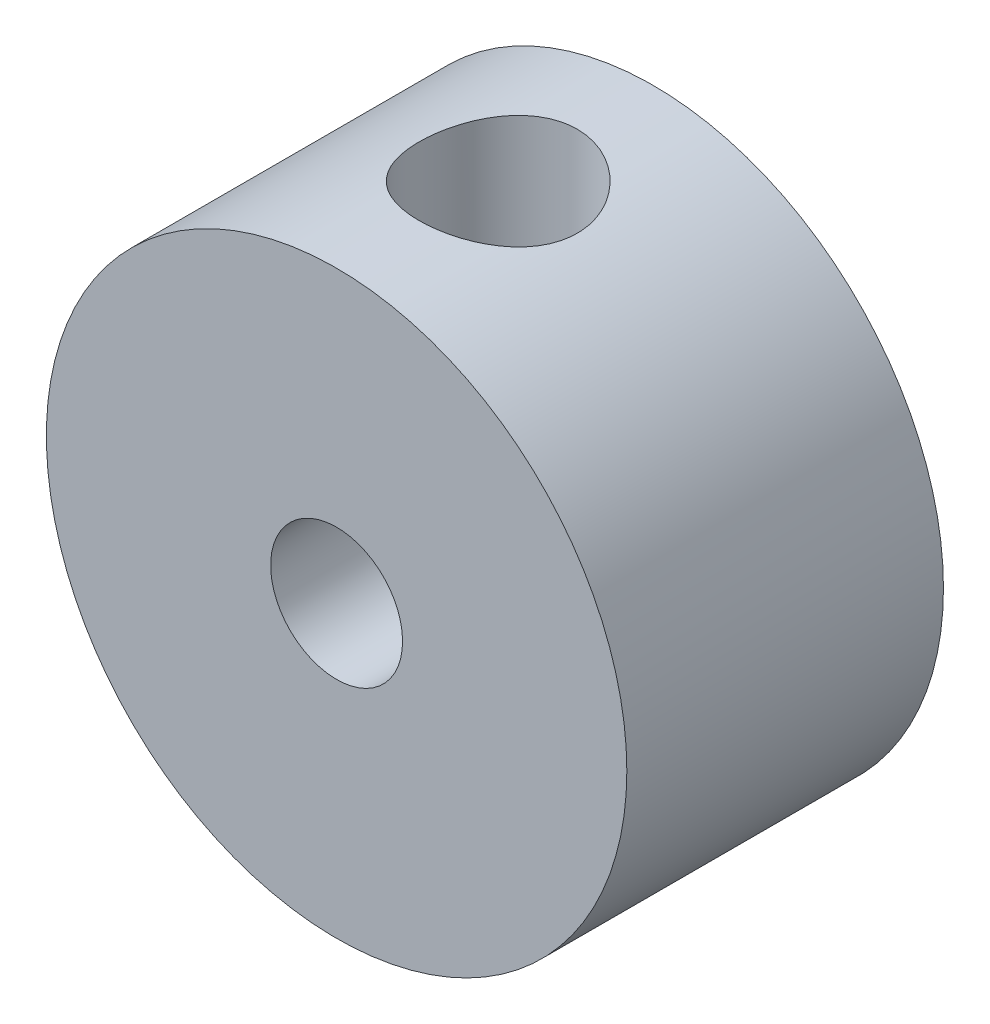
ISO-10303-21;
HEADER;
FILE_DESCRIPTION(('STEP AP214'),'2;1');
FILE_NAME('part.step','',(''),(''),'','','');
FILE_SCHEMA(('AUTOMOTIVE_DESIGN { 1 0 10303 214 1 1 1 1 }'));
ENDSEC;
DATA;
#1=APPLICATION_CONTEXT('core data for automotive mechanical design processes');
#2=APPLICATION_PROTOCOL_DEFINITION('international standard','automotive_design',2000,#1);
#3=PRODUCT_CONTEXT('',#1,'mechanical');
#4=PRODUCT('Part','Part','',(#3));
#5=PRODUCT_RELATED_PRODUCT_CATEGORY('part','',(#4));
#6=PRODUCT_DEFINITION_FORMATION('','',#4);
#7=PRODUCT_DEFINITION_CONTEXT('part definition',#1,'design');
#8=PRODUCT_DEFINITION('design','',#6,#7);
#9=PRODUCT_DEFINITION_SHAPE('','',#8);
#10=(LENGTH_UNIT() NAMED_UNIT(*) SI_UNIT(.MILLI.,.METRE.));
#11=(NAMED_UNIT(*) PLANE_ANGLE_UNIT() SI_UNIT($,.RADIAN.));
#12=(NAMED_UNIT(*) SI_UNIT($,.STERADIAN.) SOLID_ANGLE_UNIT());
#13=UNCERTAINTY_MEASURE_WITH_UNIT(LENGTH_MEASURE(1.E-05),#10,'distance_accuracy_value','');
#14=(GEOMETRIC_REPRESENTATION_CONTEXT(3) GLOBAL_UNCERTAINTY_ASSIGNED_CONTEXT((#13)) GLOBAL_UNIT_ASSIGNED_CONTEXT((#10,
#11,#12)) REPRESENTATION_CONTEXT('',''));
#15=CARTESIAN_POINT('',(0.,0.,0.));
#16=DIRECTION('',(0.,0.,1.));
#17=DIRECTION('',(1.,0.,0.));
#18=AXIS2_PLACEMENT_3D('',#15,#16,#17);
#19=CARTESIAN_POINT('',(0.,0.,6.));
#20=DIRECTION('',(0.,0.,-1.));
#21=DIRECTION('',(-1.,0.,0.));
#22=AXIS2_PLACEMENT_3D('',#19,#20,#21);
#23=CYLINDRICAL_SURFACE('',#22,5.5);
#24=CARTESIAN_POINT('',(0.,0.,6.));
#25=DIRECTION('',(0.,0.,1.));
#26=DIRECTION('',(1.,0.,0.));
#27=AXIS2_PLACEMENT_3D('',#24,#25,#26);
#28=CIRCLE('',#27,5.5);
#29=CARTESIAN_POINT('',(5.5,0.,6.));
#30=VERTEX_POINT('',#29);
#31=EDGE_CURVE('E11',#30,#30,#28,.T.);
#32=ORIENTED_EDGE('',*,*,#31,.F.);
#33=EDGE_LOOP('',(#32));
#34=FACE_BOUND('',#33,.T.);
#35=CARTESIAN_POINT('',(0.,0.,0.));
#36=DIRECTION('',(0.,0.,1.));
#37=DIRECTION('',(1.,0.,0.));
#38=AXIS2_PLACEMENT_3D('',#35,#36,#37);
#39=CIRCLE('',#38,5.5);
#40=CARTESIAN_POINT('',(5.5,0.,0.));
#41=VERTEX_POINT('',#40);
#42=EDGE_CURVE('E36',#41,#41,#39,.T.);
#43=ORIENTED_EDGE('',*,*,#42,.T.);
#44=EDGE_LOOP('',(#43));
#45=FACE_BOUND('',#44,.T.);
#46=CARTESIAN_POINT('',(0.,5.5,1.43828192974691));
#47=CARTESIAN_POINT('',(0.0826209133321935,5.49999882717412,1.43828374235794));
#48=CARTESIAN_POINT('',(0.165260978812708,5.49812007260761,1.44513099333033));
#49=CARTESIAN_POINT('',(0.328155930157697,5.49080798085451,1.47228776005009));
#50=CARTESIAN_POINT('',(0.408409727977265,5.48537304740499,1.49260332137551));
#51=CARTESIAN_POINT('',(0.564157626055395,5.47154772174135,1.54598366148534));
#52=CARTESIAN_POINT('',(0.639657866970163,5.46316123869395,1.57903158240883));
#53=CARTESIAN_POINT('',(0.78404449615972,5.44431654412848,1.65687486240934));
#54=CARTESIAN_POINT('',(0.852930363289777,5.43385816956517,1.70167114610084));
#55=CARTESIAN_POINT('',(0.983796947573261,5.41171397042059,1.80288176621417));
#56=CARTESIAN_POINT('',(1.04559512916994,5.40000641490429,1.85952737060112));
#57=CARTESIAN_POINT('',(1.15894293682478,5.37682112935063,1.98233456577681));
#58=CARTESIAN_POINT('',(1.21049117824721,5.36534343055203,2.04849744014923));
#59=CARTESIAN_POINT('',(1.30277794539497,5.34369384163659,2.18993317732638));
#60=CARTESIAN_POINT('',(1.34330426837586,5.33354930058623,2.26534907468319));
#61=CARTESIAN_POINT('',(1.41102916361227,5.31603507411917,2.42224575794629));
#62=CARTESIAN_POINT('',(1.43823031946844,5.30866485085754,2.5037253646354));
#63=CARTESIAN_POINT('',(1.47789456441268,5.2977584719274,2.66840982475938));
#64=CARTESIAN_POINT('',(1.49068960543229,5.29413612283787,2.75152887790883));
#65=CARTESIAN_POINT('',(1.50221364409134,5.29087829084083,2.91880661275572));
#66=CARTESIAN_POINT('',(1.50094540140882,5.2912420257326,3.00296508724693));
#67=CARTESIAN_POINT('',(1.48464191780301,5.29583824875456,3.16732348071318));
#68=CARTESIAN_POINT('',(1.47001073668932,5.29995718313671,3.24756716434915));
#69=CARTESIAN_POINT('',(1.42804483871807,5.3114175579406,3.40441521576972));
#70=CARTESIAN_POINT('',(1.40070906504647,5.31875926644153,3.48101928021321));
#71=CARTESIAN_POINT('',(1.3337862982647,5.33593618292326,3.62945545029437));
#72=CARTESIAN_POINT('',(1.29405951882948,5.34579959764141,3.70122113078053));
#73=CARTESIAN_POINT('',(1.20357988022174,5.36689368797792,3.83720837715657));
#74=CARTESIAN_POINT('',(1.15282476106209,5.37812464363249,3.90142839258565));
#75=CARTESIAN_POINT('',(1.03967346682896,5.40115894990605,4.02280711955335));
#76=CARTESIAN_POINT('',(0.97693864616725,5.41296874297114,4.07964937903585));
#77=CARTESIAN_POINT('',(0.842682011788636,5.43548647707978,4.1820728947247));
#78=CARTESIAN_POINT('',(0.771159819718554,5.44619437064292,4.22765366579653));
#79=CARTESIAN_POINT('',(0.620853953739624,5.46537278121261,4.30640860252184));
#80=CARTESIAN_POINT('',(0.542037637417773,5.47383251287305,4.33952326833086));
#81=CARTESIAN_POINT('',(0.37967268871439,5.48748356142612,4.39193990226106));
#82=CARTESIAN_POINT('',(0.296125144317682,5.49267562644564,4.41124503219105));
#83=CARTESIAN_POINT('',(0.129368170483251,5.49909228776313,4.43499254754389));
#84=CARTESIAN_POINT('',(0.04622429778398,5.50043163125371,4.43986492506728));
#85=CARTESIAN_POINT('',(-0.119693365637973,5.49932301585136,4.43579918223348));
#86=CARTESIAN_POINT('',(-0.202467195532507,5.49687546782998,4.42686256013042));
#87=CARTESIAN_POINT('',(-0.363745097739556,5.48854239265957,4.39578442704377));
#88=CARTESIAN_POINT('',(-0.442299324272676,5.48271986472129,4.37388473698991));
#89=CARTESIAN_POINT('',(-0.59460986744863,5.46829923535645,4.31778468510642));
#90=CARTESIAN_POINT('',(-0.668365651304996,5.45970082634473,4.28358296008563));
#91=CARTESIAN_POINT('',(-0.81064116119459,5.44041573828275,4.20306548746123));
#92=CARTESIAN_POINT('',(-0.879024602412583,5.4296902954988,4.15651844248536));
#93=CARTESIAN_POINT('',(-1.00716022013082,5.40738988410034,4.05292064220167));
#94=CARTESIAN_POINT('',(-1.06691060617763,5.39581474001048,3.9958677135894));
#95=CARTESIAN_POINT('',(-1.17791060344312,5.37269401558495,3.87086789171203));
#96=CARTESIAN_POINT('',(-1.22885627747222,5.36115944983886,3.80264854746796));
#97=CARTESIAN_POINT('',(-1.3185858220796,5.33980026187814,3.65838328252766));
#98=CARTESIAN_POINT('',(-1.35737017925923,5.32997557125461,3.58233767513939));
#99=CARTESIAN_POINT('',(-1.42138558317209,5.31326248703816,3.42494130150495));
#100=CARTESIAN_POINT('',(-1.44669352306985,5.30635748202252,3.34362366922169));
#101=CARTESIAN_POINT('',(-1.48320917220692,5.29626814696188,3.17766509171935));
#102=CARTESIAN_POINT('',(-1.49442068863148,5.29308281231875,3.09302505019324));
#103=CARTESIAN_POINT('',(-1.50219895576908,5.29088009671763,2.92594352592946));
#104=CARTESIAN_POINT('',(-1.49925533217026,5.29172336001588,2.84352634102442));
#105=CARTESIAN_POINT('',(-1.47994837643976,5.29715501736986,2.68041128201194));
#106=CARTESIAN_POINT('',(-1.46358542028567,5.30174330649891,2.59971335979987));
#107=CARTESIAN_POINT('',(-1.41819408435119,5.31406316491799,2.44297561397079));
#108=CARTESIAN_POINT('',(-1.38927395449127,5.32176783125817,2.36690217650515));
#109=CARTESIAN_POINT('',(-1.31967304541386,5.33945189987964,2.22062865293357));
#110=CARTESIAN_POINT('',(-1.27899034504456,5.34943167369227,2.15042952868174));
#111=CARTESIAN_POINT('',(-1.18555430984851,5.37092379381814,2.01557133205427));
#112=CARTESIAN_POINT('',(-1.13246901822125,5.38247375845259,1.9511482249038));
#113=CARTESIAN_POINT('',(-1.01636011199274,5.40559990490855,1.83196552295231));
#114=CARTESIAN_POINT('',(-0.953334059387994,5.41717609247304,1.77720830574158));
#115=CARTESIAN_POINT('',(-0.817407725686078,5.43936459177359,1.67768731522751));
#116=CARTESIAN_POINT('',(-0.744315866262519,5.44994907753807,1.63317844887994));
#117=CARTESIAN_POINT('',(-0.591399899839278,5.46865263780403,1.55714949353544));
#118=CARTESIAN_POINT('',(-0.51157995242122,5.47677322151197,1.52562144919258));
#119=CARTESIAN_POINT('',(-0.36010010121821,5.48864193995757,1.48034241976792));
#120=CARTESIAN_POINT('',(-0.289064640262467,5.49286947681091,1.46460737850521));
#121=CARTESIAN_POINT('',(-0.145357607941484,5.49854887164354,1.44357690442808));
#122=CARTESIAN_POINT('',(-0.0726862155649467,5.5000010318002,1.43828033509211));
#123=CARTESIAN_POINT('',(0.,5.5,1.43828192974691));
#124=B_SPLINE_CURVE_WITH_KNOTS('',3,(#46,#47,#48,#49,#50,#51,#52,#53,#54,#55,#56,#57,#58,#59,
#60,#61,#62,#63,#64,#65,#66,#67,#68,#69,#70,#71,#72,#73,#74,#75,#76,#77,#78,#79,#80,#81,#82,#83,
#84,#85,#86,#87,#88,#89,#90,#91,#92,#93,#94,#95,#96,#97,#98,#99,#100,#101,#102,#103,#104,#105,
#106,#107,#108,#109,#110,#111,#112,#113,#114,#115,#116,#117,#118,#119,#120,#121,#122,#123),
.UNSPECIFIED.,.T.,.F.,(4,2,2,2,2,2,2,2,2,2,2,2,2,2,2,2,2,2,2,2,2,2,2,2,2,2,2,2,2,2,2,2,2,2,2,2,
2,2,4),(0.,0.247596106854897,0.4953034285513,0.742683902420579,0.990083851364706,
1.24285878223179,1.49566783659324,1.75304593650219,2.01037411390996,2.26164304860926,
2.51286267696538,2.75672886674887,3.00061534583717,3.24735926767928,3.49415380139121,
3.74938528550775,4.00462776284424,4.26107349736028,4.51746049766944,4.76612811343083,
5.01476875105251,5.25891111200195,5.50308053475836,5.75219469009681,6.00136043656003,
6.2579007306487,6.51443075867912,6.76948096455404,7.02446227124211,7.27068852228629,
7.51690787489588,7.76104555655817,8.00522313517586,8.25689011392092,8.50861891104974,
8.76605872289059,9.02334052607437,9.2411883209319,9.45901239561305),.UNSPECIFIED.);
#125=CARTESIAN_POINT('',(0.,5.5,1.43828192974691));
#126=VERTEX_POINT('',#125);
#127=EDGE_CURVE('E67',#126,#126,#124,.T.);
#128=ORIENTED_EDGE('',*,*,#127,.T.);
#129=EDGE_LOOP('',(#128));
#130=FACE_BOUND('',#129,.T.);
#131=ADVANCED_FACE('F33',(#34,#45,#130),#23,.T.);
#132=CARTESIAN_POINT('',(0.,0.,6.));
#133=DIRECTION('',(0.,0.,-1.));
#134=DIRECTION('',(-1.,0.,0.));
#135=AXIS2_PLACEMENT_3D('',#132,#133,#134);
#136=CYLINDRICAL_SURFACE('',#135,1.25);
#137=CARTESIAN_POINT('',(0.,0.,6.));
#138=DIRECTION('',(0.,0.,1.));
#139=DIRECTION('',(1.,0.,0.));
#140=AXIS2_PLACEMENT_3D('',#137,#138,#139);
#141=CIRCLE('',#140,1.25);
#142=CARTESIAN_POINT('',(1.25,0.,6.));
#143=VERTEX_POINT('',#142);
#144=EDGE_CURVE('E98',#143,#143,#141,.T.);
#145=ORIENTED_EDGE('',*,*,#144,.T.);
#146=EDGE_LOOP('',(#145));
#147=FACE_BOUND('',#146,.T.);
#148=CARTESIAN_POINT('',(0.,0.,0.));
#149=DIRECTION('',(0.,0.,1.));
#150=DIRECTION('',(1.,0.,0.));
#151=AXIS2_PLACEMENT_3D('',#148,#149,#150);
#152=CIRCLE('',#151,1.25);
#153=CARTESIAN_POINT('',(1.25,0.,0.));
#154=VERTEX_POINT('',#153);
#155=EDGE_CURVE('E101',#154,#154,#152,.T.);
#156=ORIENTED_EDGE('',*,*,#155,.F.);
#157=EDGE_LOOP('',(#156));
#158=FACE_BOUND('',#157,.T.);
#159=CARTESIAN_POINT('',(1.25,0.,3.76743812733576));
#160=CARTESIAN_POINT('',(1.25000393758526,0.0223371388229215,3.76742511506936));
#161=CARTESIAN_POINT('',(1.24940101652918,0.0446590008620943,3.76834159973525));
#162=CARTESIAN_POINT('',(1.24702039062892,0.0890577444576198,3.77191698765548));
#163=CARTESIAN_POINT('',(1.24524495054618,0.111135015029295,3.7745725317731));
#164=CARTESIAN_POINT('',(1.23828571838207,0.176143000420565,3.78487367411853));
#165=CARTESIAN_POINT('',(1.23146632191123,0.218538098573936,3.79486108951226));
#166=CARTESIAN_POINT('',(1.21046665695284,0.317420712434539,3.82439969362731));
#167=CARTESIAN_POINT('',(1.1944384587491,0.372816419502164,3.84617398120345));
#168=CARTESIAN_POINT('',(1.15585441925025,0.47931250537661,3.89482639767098));
#169=CARTESIAN_POINT('',(1.13324426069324,0.530372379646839,3.92174632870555));
#170=CARTESIAN_POINT('',(1.07079374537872,0.649805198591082,3.99012870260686));
#171=CARTESIAN_POINT('',(1.02775598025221,0.715843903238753,4.03275597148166));
#172=CARTESIAN_POINT('',(0.929921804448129,0.838986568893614,4.11702094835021));
#173=CARTESIAN_POINT('',(0.875151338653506,0.89610977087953,4.15866061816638));
#174=CARTESIAN_POINT('',(0.76666906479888,0.989285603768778,4.22881097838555));
#175=CARTESIAN_POINT('',(0.71518789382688,1.02723877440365,4.25823489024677));
#176=CARTESIAN_POINT('',(0.605147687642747,1.09566348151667,4.31215784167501));
#177=CARTESIAN_POINT('',(0.546598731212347,1.12614548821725,4.33666376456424));
#178=CARTESIAN_POINT('',(0.433964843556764,1.17355642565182,4.37514634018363));
#179=CARTESIAN_POINT('',(0.380858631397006,1.19191749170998,4.39021094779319));
#180=CARTESIAN_POINT('',(0.271415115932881,1.22149067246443,4.41458428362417));
#181=CARTESIAN_POINT('',(0.215079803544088,1.23270714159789,4.42389651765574));
#182=CARTESIAN_POINT('',(0.100453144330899,1.24730072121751,4.43602769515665));
#183=CARTESIAN_POINT('',(0.0421546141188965,1.25064491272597,4.43881937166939));
#184=CARTESIAN_POINT('',(-0.0742636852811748,1.24914888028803,4.43757265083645));
#185=CARTESIAN_POINT('',(-0.132383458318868,1.24430883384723,4.43353440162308));
#186=CARTESIAN_POINT('',(-0.242722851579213,1.22739291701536,4.41948865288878));
#187=CARTESIAN_POINT('',(-0.295076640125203,1.21582458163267,4.40990005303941));
#188=CARTESIAN_POINT('',(-0.396812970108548,1.18652609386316,4.38578846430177));
#189=CARTESIAN_POINT('',(-0.44619506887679,1.16879502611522,4.37126474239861));
#190=CARTESIAN_POINT('',(-0.545266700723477,1.12620463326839,4.33673377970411));
#191=CARTESIAN_POINT('',(-0.594620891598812,1.10086514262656,4.31636363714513));
#192=CARTESIAN_POINT('',(-0.688391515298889,1.04480006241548,4.27200389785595));
#193=CARTESIAN_POINT('',(-0.732803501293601,1.01406968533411,4.24801108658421));
#194=CARTESIAN_POINT('',(-0.836393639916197,0.932277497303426,4.1855347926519));
#195=CARTESIAN_POINT('',(-0.892549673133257,0.878496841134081,4.14558634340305));
#196=CARTESIAN_POINT('',(-0.993638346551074,0.762324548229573,4.0638501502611));
#197=CARTESIAN_POINT('',(-1.03855095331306,0.699917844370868,4.02205927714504));
#198=CARTESIAN_POINT('',(-1.10641719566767,0.584425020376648,3.95196333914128));
#199=CARTESIAN_POINT('',(-1.13203412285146,0.53327475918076,3.92302781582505));
#200=CARTESIAN_POINT('',(-1.1765638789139,0.426087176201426,3.86935840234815));
#201=CARTESIAN_POINT('',(-1.19549424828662,0.370063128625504,3.84461360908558));
#202=CARTESIAN_POINT('',(-1.22094057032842,0.27118213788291,3.80984261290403));
#203=CARTESIAN_POINT('',(-1.22948604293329,0.229635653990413,3.79763186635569));
#204=CARTESIAN_POINT('',(-1.24233043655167,0.144695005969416,3.77896823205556));
#205=CARTESIAN_POINT('',(-1.24664529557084,0.101308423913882,3.77249374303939));
#206=CARTESIAN_POINT('',(-1.24956019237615,0.0384510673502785,3.76809694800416));
#207=CARTESIAN_POINT('',(-1.25000852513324,0.0192254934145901,3.76741414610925));
#208=CARTESIAN_POINT('',(-1.25000000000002,-3.29003667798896E-13,3.76743812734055));
#209=B_SPLINE_CURVE_WITH_KNOTS('',3,(#159,#160,#161,#162,#163,#164,#165,#166,#167,#168,#169,
#170,#171,#172,#173,#174,#175,#176,#177,#178,#179,#180,#181,#182,#183,#184,#185,#186,#187,#188,
#189,#190,#191,#192,#193,#194,#195,#196,#197,#198,#199,#200,#201,#202,#203,#204,#205,#206,#207,
#208),.UNSPECIFIED.,.F.,.F.,(4,2,2,2,2,2,2,2,2,2,2,2,2,2,2,2,2,2,2,2,2,2,2,2,4),(0.,
0.0669579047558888,0.133786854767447,0.265412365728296,0.449324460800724,0.634799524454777,
0.902330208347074,1.16927529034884,1.37970673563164,1.58984157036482,1.76364059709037,
1.93733359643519,2.11175163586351,2.28616589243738,2.44887210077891,2.61160248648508,
2.78825896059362,2.9650731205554,3.22597445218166,3.48733739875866,3.67918343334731,
3.87052240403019,4.0024722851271,4.13392313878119,4.19159133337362),.UNSPECIFIED.);
#210=CARTESIAN_POINT('',(1.25,0.,3.76743812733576));
#211=VERTEX_POINT('',#210);
#212=CARTESIAN_POINT('',(-1.25,0.,3.76743812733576));
#213=VERTEX_POINT('',#212);
#214=EDGE_CURVE('E47',#211,#213,#209,.T.);
#215=ORIENTED_EDGE('',*,*,#214,.F.);
#216=DIRECTION('',(0.,0.,-1.));
#217=VECTOR('',#216,1.);
#218=CARTESIAN_POINT('',(1.25,0.,6.));
#219=LINE('',#218,#217);
#220=CARTESIAN_POINT('',(1.25,0.,2.10912573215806));
#221=VERTEX_POINT('',#220);
#222=EDGE_CURVE('E72',#221,#211,#219,.F.);
#223=ORIENTED_EDGE('',*,*,#222,.F.);
#224=CARTESIAN_POINT('',(-1.25,0.,2.10912573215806));
#225=CARTESIAN_POINT('',(-1.25000393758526,0.0223371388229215,2.10913874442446));
#226=CARTESIAN_POINT('',(-1.24940101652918,0.0446590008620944,2.10822225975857));
#227=CARTESIAN_POINT('',(-1.24702039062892,0.0890577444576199,2.10464687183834));
#228=CARTESIAN_POINT('',(-1.24524495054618,0.111135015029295,2.10199132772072));
#229=CARTESIAN_POINT('',(-1.23828571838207,0.176143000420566,2.0916901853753));
#230=CARTESIAN_POINT('',(-1.23146632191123,0.218538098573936,2.08170276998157));
#231=CARTESIAN_POINT('',(-1.21046665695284,0.317420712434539,2.05216416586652));
#232=CARTESIAN_POINT('',(-1.1944384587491,0.372816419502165,2.03038987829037));
#233=CARTESIAN_POINT('',(-1.15585441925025,0.479312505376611,1.98173746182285));
#234=CARTESIAN_POINT('',(-1.13324426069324,0.53037237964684,1.95481753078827));
#235=CARTESIAN_POINT('',(-1.07079374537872,0.649805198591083,1.88643515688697));
#236=CARTESIAN_POINT('',(-1.02775598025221,0.715843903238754,1.84380788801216));
#237=CARTESIAN_POINT('',(-0.929921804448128,0.838986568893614,1.75954291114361));
#238=CARTESIAN_POINT('',(-0.875151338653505,0.89610977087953,1.71790324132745));
#239=CARTESIAN_POINT('',(-0.76666906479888,0.989285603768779,1.64775288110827));
#240=CARTESIAN_POINT('',(-0.715187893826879,1.02723877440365,1.61832896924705));
#241=CARTESIAN_POINT('',(-0.605147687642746,1.09566348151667,1.56440601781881));
#242=CARTESIAN_POINT('',(-0.546598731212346,1.12614548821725,1.53990009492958));
#243=CARTESIAN_POINT('',(-0.433964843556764,1.17355642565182,1.5014175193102));
#244=CARTESIAN_POINT('',(-0.380858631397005,1.19191749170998,1.48635291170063));
#245=CARTESIAN_POINT('',(-0.271415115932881,1.22149067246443,1.46197957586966));
#246=CARTESIAN_POINT('',(-0.215079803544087,1.23270714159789,1.45266734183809));
#247=CARTESIAN_POINT('',(-0.100453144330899,1.24730072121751,1.44053616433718));
#248=CARTESIAN_POINT('',(-0.0421546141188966,1.25064491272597,1.43774448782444));
#249=CARTESIAN_POINT('',(0.0742636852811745,1.24914888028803,1.43899120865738));
#250=CARTESIAN_POINT('',(0.132383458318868,1.24430883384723,1.44302945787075));
#251=CARTESIAN_POINT('',(0.242722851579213,1.22739291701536,1.45707520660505));
#252=CARTESIAN_POINT('',(0.295076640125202,1.21582458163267,1.46666380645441));
#253=CARTESIAN_POINT('',(0.396812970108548,1.18652609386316,1.49077539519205));
#254=CARTESIAN_POINT('',(0.44619506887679,1.16879502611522,1.50529911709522));
#255=CARTESIAN_POINT('',(0.545266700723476,1.12620463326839,1.53983007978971));
#256=CARTESIAN_POINT('',(0.594620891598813,1.10086514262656,1.56020022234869));
#257=CARTESIAN_POINT('',(0.688391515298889,1.04480006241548,1.60455996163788));
#258=CARTESIAN_POINT('',(0.732803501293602,1.01406968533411,1.62855277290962));
#259=CARTESIAN_POINT('',(0.836393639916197,0.932277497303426,1.69102906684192));
#260=CARTESIAN_POINT('',(0.892549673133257,0.878496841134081,1.73097751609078));
#261=CARTESIAN_POINT('',(0.993638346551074,0.762324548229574,1.81271370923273));
#262=CARTESIAN_POINT('',(1.03855095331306,0.699917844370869,1.85450458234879));
#263=CARTESIAN_POINT('',(1.10641719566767,0.584425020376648,1.92460052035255));
#264=CARTESIAN_POINT('',(1.13203412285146,0.533274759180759,1.95353604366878));
#265=CARTESIAN_POINT('',(1.1765638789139,0.426087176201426,2.00720545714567));
#266=CARTESIAN_POINT('',(1.19549424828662,0.370063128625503,2.03195025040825));
#267=CARTESIAN_POINT('',(1.22094057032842,0.271182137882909,2.06672124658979));
#268=CARTESIAN_POINT('',(1.22948604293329,0.229635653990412,2.07893199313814));
#269=CARTESIAN_POINT('',(1.24233043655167,0.144695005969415,2.09759562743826));
#270=CARTESIAN_POINT('',(1.24664529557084,0.101308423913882,2.10407011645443));
#271=CARTESIAN_POINT('',(1.24956019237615,0.038451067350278,2.10846691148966));
#272=CARTESIAN_POINT('',(1.25000852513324,0.0192254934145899,2.10914971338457));
#273=CARTESIAN_POINT('',(1.25000000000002,-3.29062680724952E-13,2.10912573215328));
#274=B_SPLINE_CURVE_WITH_KNOTS('',3,(#224,#225,#226,#227,#228,#229,#230,#231,#232,#233,#234,
#235,#236,#237,#238,#239,#240,#241,#242,#243,#244,#245,#246,#247,#248,#249,#250,#251,#252,#253,
#254,#255,#256,#257,#258,#259,#260,#261,#262,#263,#264,#265,#266,#267,#268,#269,#270,#271,#272,
#273),.UNSPECIFIED.,.F.,.F.,(4,2,2,2,2,2,2,2,2,2,2,2,2,2,2,2,2,2,2,2,2,2,2,2,4),(0.,
0.0669579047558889,0.133786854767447,0.265412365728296,0.449324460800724,0.634799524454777,
0.902330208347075,1.16927529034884,1.37970673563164,1.58984157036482,1.76364059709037,
1.93733359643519,2.11175163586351,2.28616589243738,2.44887210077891,2.61160248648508,
2.78825896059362,2.9650731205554,3.22597445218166,3.48733739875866,3.67918343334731,
3.87052240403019,4.00247228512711,4.13392313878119,4.19159133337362),.UNSPECIFIED.);
#275=CARTESIAN_POINT('',(-1.25,0.,2.10912573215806));
#276=VERTEX_POINT('',#275);
#277=EDGE_CURVE('E63',#276,#221,#274,.T.);
#278=ORIENTED_EDGE('',*,*,#277,.F.);
#279=DIRECTION('',(0.,0.,-1.));
#280=VECTOR('',#279,1.);
#281=CARTESIAN_POINT('',(-1.25,0.,6.));
#282=LINE('',#281,#280);
#283=EDGE_CURVE('E69',#213,#276,#282,.T.);
#284=ORIENTED_EDGE('',*,*,#283,.F.);
#285=EDGE_LOOP('',(#215,#223,#278,#284));
#286=FACE_BOUND('',#285,.T.);
#287=ADVANCED_FACE('F74',(#147,#158,#286),#136,.F.);
#288=CARTESIAN_POINT('',(0.,0.,6.));
#289=DIRECTION('',(0.,0.,1.));
#290=DIRECTION('',(1.,0.,0.));
#291=AXIS2_PLACEMENT_3D('',#288,#289,#290);
#292=PLANE('',#291);
#293=ORIENTED_EDGE('',*,*,#31,.T.);
#294=EDGE_LOOP('',(#293));
#295=FACE_BOUND('',#294,.T.);
#296=ORIENTED_EDGE('',*,*,#144,.F.);
#297=EDGE_LOOP('',(#296));
#298=FACE_BOUND('',#297,.T.);
#299=ADVANCED_FACE('F117',(#295,#298),#292,.T.);
#300=CARTESIAN_POINT('',(0.,0.,0.));
#301=DIRECTION('',(0.,0.,1.));
#302=DIRECTION('',(1.,0.,0.));
#303=AXIS2_PLACEMENT_3D('',#300,#301,#302);
#304=PLANE('',#303);
#305=ORIENTED_EDGE('',*,*,#42,.F.);
#306=EDGE_LOOP('',(#305));
#307=FACE_BOUND('',#306,.T.);
#308=ORIENTED_EDGE('',*,*,#155,.T.);
#309=EDGE_LOOP('',(#308));
#310=FACE_BOUND('',#309,.T.);
#311=ADVANCED_FACE('F111',(#307,#310),#304,.F.);
#312=CARTESIAN_POINT('',(0.,5.501,2.93828192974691));
#313=DIRECTION('',(0.,-1.,0.));
#314=DIRECTION('',(0.,0.,-1.));
#315=AXIS2_PLACEMENT_3D('',#312,#313,#314);
#316=CYLINDRICAL_SURFACE('',#315,1.5);
#317=ORIENTED_EDGE('',*,*,#277,.T.);
#318=CARTESIAN_POINT('',(0.,0.,2.93828192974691));
#319=DIRECTION('',(0.,1.,0.));
#320=DIRECTION('',(0.,0.,1.));
#321=AXIS2_PLACEMENT_3D('',#318,#319,#320);
#322=CIRCLE('',#321,1.5);
#323=EDGE_CURVE('E53',#211,#221,#322,.T.);
#324=ORIENTED_EDGE('',*,*,#323,.F.);
#325=ORIENTED_EDGE('',*,*,#214,.T.);
#326=EDGE_CURVE('E58',#276,#213,#322,.T.);
#327=ORIENTED_EDGE('',*,*,#326,.F.);
#328=EDGE_LOOP('',(#317,#324,#325,#327));
#329=FACE_BOUND('',#328,.T.);
#330=ORIENTED_EDGE('',*,*,#127,.F.);
#331=EDGE_LOOP('',(#330));
#332=FACE_BOUND('',#331,.T.);
#333=ADVANCED_FACE('F60',(#329,#332),#316,.F.);
#334=CARTESIAN_POINT('',(0.,0.,2.93828192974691));
#335=DIRECTION('',(0.,1.,0.));
#336=DIRECTION('',(0.,0.,1.));
#337=AXIS2_PLACEMENT_3D('',#334,#335,#336);
#338=PLANE('',#337);
#339=ORIENTED_EDGE('',*,*,#222,.T.);
#340=ORIENTED_EDGE('',*,*,#323,.T.);
#341=EDGE_LOOP('',(#339,#340));
#342=FACE_BOUND('',#341,.T.);
#343=ADVANCED_FACE('F105',(#342),#338,.T.);
#344=ORIENTED_EDGE('',*,*,#283,.T.);
#345=ORIENTED_EDGE('',*,*,#326,.T.);
#346=EDGE_LOOP('',(#344,#345));
#347=FACE_BOUND('',#346,.T.);
#348=ADVANCED_FACE('F70',(#347),#338,.T.);
#349=CLOSED_SHELL('',(#131,#287,#299,#311,#333,#343,#348));
#350=MANIFOLD_SOLID_BREP('B2',#349);
#351=ADVANCED_BREP_SHAPE_REPRESENTATION('',(#18,#350),#14);
#352=SHAPE_DEFINITION_REPRESENTATION(#9,#351);
ENDSEC;
END-ISO-10303-21;
